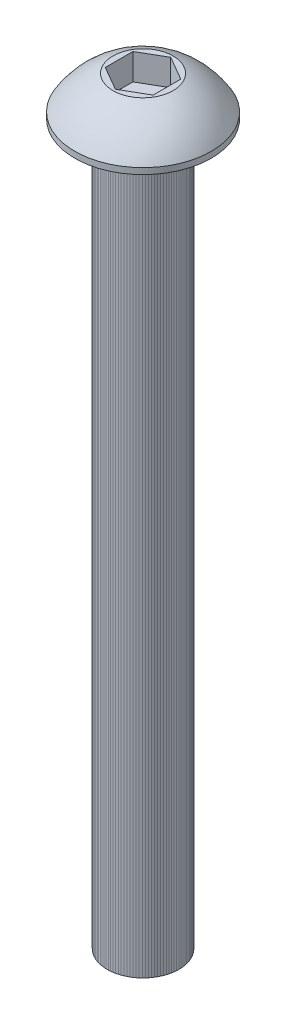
ISO-10303-21;
HEADER;
FILE_DESCRIPTION(('STEP AP214'),'2;1');
FILE_NAME('part.step','',(''),(''),'','','');
FILE_SCHEMA(('AUTOMOTIVE_DESIGN { 1 0 10303 214 1 1 1 1 }'));
ENDSEC;
DATA;
#1=APPLICATION_CONTEXT('core data for automotive mechanical design processes');
#2=APPLICATION_PROTOCOL_DEFINITION('international standard','automotive_design',2000,#1);
#3=PRODUCT_CONTEXT('',#1,'mechanical');
#4=PRODUCT('Part','Part','',(#3));
#5=PRODUCT_RELATED_PRODUCT_CATEGORY('part','',(#4));
#6=PRODUCT_DEFINITION_FORMATION('','',#4);
#7=PRODUCT_DEFINITION_CONTEXT('part definition',#1,'design');
#8=PRODUCT_DEFINITION('design','',#6,#7);
#9=PRODUCT_DEFINITION_SHAPE('','',#8);
#10=(LENGTH_UNIT() NAMED_UNIT(*) SI_UNIT(.MILLI.,.METRE.));
#11=(NAMED_UNIT(*) PLANE_ANGLE_UNIT() SI_UNIT($,.RADIAN.));
#12=(NAMED_UNIT(*) SI_UNIT($,.STERADIAN.) SOLID_ANGLE_UNIT());
#13=UNCERTAINTY_MEASURE_WITH_UNIT(LENGTH_MEASURE(1.E-05),#10,'distance_accuracy_value','');
#14=(GEOMETRIC_REPRESENTATION_CONTEXT(3) GLOBAL_UNCERTAINTY_ASSIGNED_CONTEXT((#13)) GLOBAL_UNIT_ASSIGNED_CONTEXT((#10,
#11,#12)) REPRESENTATION_CONTEXT('',''));
#15=CARTESIAN_POINT('',(0.,0.,0.));
#16=DIRECTION('',(0.,0.,1.));
#17=DIRECTION('',(1.,0.,0.));
#18=AXIS2_PLACEMENT_3D('',#15,#16,#17);
#19=CARTESIAN_POINT('',(0.,0.55,0.));
#20=DIRECTION('',(0.,1.,0.));
#21=DIRECTION('',(0.,0.,1.));
#22=AXIS2_PLACEMENT_3D('',#19,#20,#21);
#23=PLANE('',#22);
#24=DIRECTION('',(0.866025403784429,0.,0.500000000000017));
#25=VECTOR('',#24,1.);
#26=CARTESIAN_POINT('',(-1.,0.55,0.5773502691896));
#27=LINE('',#26,#25);
#28=CARTESIAN_POINT('',(-1.,0.55,0.5773502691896));
#29=VERTEX_POINT('',#28);
#30=CARTESIAN_POINT('',(0.,0.55,1.15470053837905));
#31=VERTEX_POINT('',#30);
#32=EDGE_CURVE('P0_E92',#29,#31,#27,.T.);
#33=ORIENTED_EDGE('',*,*,#32,.T.);
#34=DIRECTION('',(0.866025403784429,0.,-0.500000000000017));
#35=VECTOR('',#34,1.);
#36=CARTESIAN_POINT('',(0.,0.55,1.154700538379));
#37=LINE('',#36,#35);
#38=CARTESIAN_POINT('',(0.999999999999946,0.55,0.577350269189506));
#39=VERTEX_POINT('',#38);
#40=EDGE_CURVE('P0_E89',#31,#39,#37,.T.);
#41=ORIENTED_EDGE('',*,*,#40,.T.);
#42=DIRECTION('',(0.,0.,-1.));
#43=VECTOR('',#42,1.);
#44=CARTESIAN_POINT('',(1.,0.55,0.5773502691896));
#45=LINE('',#44,#43);
#46=CARTESIAN_POINT('',(1.,0.55,-0.5773502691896));
#47=VERTEX_POINT('',#46);
#48=EDGE_CURVE('P0_E85',#39,#47,#45,.T.);
#49=ORIENTED_EDGE('',*,*,#48,.T.);
#50=DIRECTION('',(-0.866025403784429,0.,-0.500000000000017));
#51=VECTOR('',#50,1.);
#52=CARTESIAN_POINT('',(1.,0.55,-0.5773502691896));
#53=LINE('',#52,#51);
#54=CARTESIAN_POINT('',(0.,0.55,-1.15470053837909));
#55=VERTEX_POINT('',#54);
#56=EDGE_CURVE('P0_E115',#47,#55,#53,.T.);
#57=ORIENTED_EDGE('',*,*,#56,.T.);
#58=DIRECTION('',(-0.866025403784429,0.,0.500000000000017));
#59=VECTOR('',#58,1.);
#60=CARTESIAN_POINT('',(0.,0.55,-1.154700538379));
#61=LINE('',#60,#59);
#62=CARTESIAN_POINT('',(-0.999999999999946,0.55,-0.577350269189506));
#63=VERTEX_POINT('',#62);
#64=EDGE_CURVE('P0_E171',#55,#63,#61,.T.);
#65=ORIENTED_EDGE('',*,*,#64,.T.);
#66=DIRECTION('',(0.,0.,1.));
#67=VECTOR('',#66,1.);
#68=CARTESIAN_POINT('',(-1.,0.55,-0.5773502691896));
#69=LINE('',#68,#67);
#70=EDGE_CURVE('P0_E165',#63,#29,#69,.T.);
#71=ORIENTED_EDGE('',*,*,#70,.T.);
#72=EDGE_LOOP('',(#33,#41,#49,#57,#65,#71));
#73=FACE_BOUND('',#72,.T.);
#74=ADVANCED_FACE('P0_F17',(#73),#23,.T.);
#75=CARTESIAN_POINT('',(0.,1.65,1.154700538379));
#76=DIRECTION('',(0.500000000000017,0.,0.866025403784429));
#77=DIRECTION('',(0.866025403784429,0.,-0.500000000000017));
#78=AXIS2_PLACEMENT_3D('',#75,#76,#77);
#79=PLANE('',#78);
#80=ORIENTED_EDGE('',*,*,#40,.F.);
#81=DIRECTION('',(0.,1.,0.));
#82=VECTOR('',#81,1.);
#83=CARTESIAN_POINT('',(-1.08637057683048E-13,1.65,1.15470053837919));
#84=LINE('',#83,#82);
#85=CARTESIAN_POINT('',(0.,1.65,1.15470053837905));
#86=VERTEX_POINT('',#85);
#87=EDGE_CURVE('P0_E158',#31,#86,#84,.T.);
#88=ORIENTED_EDGE('',*,*,#87,.T.);
#89=DIRECTION('',(0.866025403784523,0.,-0.499999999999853));
#90=VECTOR('',#89,1.);
#91=CARTESIAN_POINT('',(0.,1.65,1.154700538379));
#92=LINE('',#91,#90);
#93=CARTESIAN_POINT('',(0.999999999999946,1.65,0.577350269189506));
#94=VERTEX_POINT('',#93);
#95=EDGE_CURVE('P0_E101',#86,#94,#92,.T.);
#96=ORIENTED_EDGE('',*,*,#95,.T.);
#97=DIRECTION('',(0.,1.,0.));
#98=VECTOR('',#97,1.);
#99=CARTESIAN_POINT('',(1.,1.65,0.5773502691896));
#100=LINE('',#99,#98);
#101=EDGE_CURVE('P0_E96',#94,#39,#100,.F.);
#102=ORIENTED_EDGE('',*,*,#101,.T.);
#103=EDGE_LOOP('',(#80,#88,#96,#102));
#104=FACE_BOUND('',#103,.T.);
#105=ADVANCED_FACE('P0_F99',(#104),#79,.F.);
#106=CARTESIAN_POINT('',(1.,1.65,0.5773502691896));
#107=DIRECTION('',(1.,0.,0.));
#108=DIRECTION('',(0.,0.,-1.));
#109=AXIS2_PLACEMENT_3D('',#106,#107,#108);
#110=PLANE('',#109);
#111=ORIENTED_EDGE('',*,*,#48,.F.);
#112=ORIENTED_EDGE('',*,*,#101,.F.);
#113=DIRECTION('',(0.,0.,-1.));
#114=VECTOR('',#113,1.);
#115=CARTESIAN_POINT('',(1.,1.65,0.));
#116=LINE('',#115,#114);
#117=CARTESIAN_POINT('',(1.,1.65,-0.5773502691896));
#118=VERTEX_POINT('',#117);
#119=EDGE_CURVE('P0_E154',#94,#118,#116,.T.);
#120=ORIENTED_EDGE('',*,*,#119,.T.);
#121=DIRECTION('',(0.,1.,0.));
#122=VECTOR('',#121,1.);
#123=CARTESIAN_POINT('',(1.,1.65,-0.5773502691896));
#124=LINE('',#123,#122);
#125=EDGE_CURVE('P0_E108',#118,#47,#124,.F.);
#126=ORIENTED_EDGE('',*,*,#125,.T.);
#127=EDGE_LOOP('',(#111,#112,#120,#126));
#128=FACE_BOUND('',#127,.T.);
#129=ADVANCED_FACE('P0_F106',(#128),#110,.F.);
#130=CARTESIAN_POINT('',(1.,1.65,-0.5773502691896));
#131=DIRECTION('',(0.500000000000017,0.,-0.866025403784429));
#132=DIRECTION('',(-0.866025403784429,0.,-0.500000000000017));
#133=AXIS2_PLACEMENT_3D('',#130,#131,#132);
#134=PLANE('',#133);
#135=ORIENTED_EDGE('',*,*,#56,.F.);
#136=ORIENTED_EDGE('',*,*,#125,.F.);
#137=DIRECTION('',(-0.866025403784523,0.,-0.499999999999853));
#138=VECTOR('',#137,1.);
#139=CARTESIAN_POINT('',(1.,1.65,-0.5773502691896));
#140=LINE('',#139,#138);
#141=CARTESIAN_POINT('',(0.,1.65,-1.15470053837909));
#142=VERTEX_POINT('',#141);
#143=EDGE_CURVE('P0_E152',#118,#142,#140,.T.);
#144=ORIENTED_EDGE('',*,*,#143,.T.);
#145=DIRECTION('',(0.,1.,0.));
#146=VECTOR('',#145,1.);
#147=CARTESIAN_POINT('',(0.,1.65,-1.154700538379));
#148=LINE('',#147,#146);
#149=EDGE_CURVE('P0_E174',#142,#55,#148,.F.);
#150=ORIENTED_EDGE('',*,*,#149,.T.);
#151=EDGE_LOOP('',(#135,#136,#144,#150));
#152=FACE_BOUND('',#151,.T.);
#153=ADVANCED_FACE('P0_F180',(#152),#134,.F.);
#154=CARTESIAN_POINT('',(0.,1.65,-1.154700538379));
#155=DIRECTION('',(-0.500000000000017,0.,-0.866025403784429));
#156=DIRECTION('',(-0.866025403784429,0.,0.500000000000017));
#157=AXIS2_PLACEMENT_3D('',#154,#155,#156);
#158=PLANE('',#157);
#159=ORIENTED_EDGE('',*,*,#64,.F.);
#160=ORIENTED_EDGE('',*,*,#149,.F.);
#161=DIRECTION('',(-0.866025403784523,0.,0.499999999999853));
#162=VECTOR('',#161,1.);
#163=CARTESIAN_POINT('',(0.,1.65,-1.154700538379));
#164=LINE('',#163,#162);
#165=CARTESIAN_POINT('',(-0.999999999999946,1.65,-0.577350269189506));
#166=VERTEX_POINT('',#165);
#167=EDGE_CURVE('P0_E145',#142,#166,#164,.T.);
#168=ORIENTED_EDGE('',*,*,#167,.T.);
#169=DIRECTION('',(0.,1.,0.));
#170=VECTOR('',#169,1.);
#171=CARTESIAN_POINT('',(-1.,1.65,-0.5773502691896));
#172=LINE('',#171,#170);
#173=EDGE_CURVE('P0_E168',#166,#63,#172,.F.);
#174=ORIENTED_EDGE('',*,*,#173,.T.);
#175=EDGE_LOOP('',(#159,#160,#168,#174));
#176=FACE_BOUND('',#175,.T.);
#177=ADVANCED_FACE('P0_F184',(#176),#158,.F.);
#178=CARTESIAN_POINT('',(-1.,1.65,-0.5773502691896));
#179=DIRECTION('',(-1.,0.,0.));
#180=DIRECTION('',(0.,0.,1.));
#181=AXIS2_PLACEMENT_3D('',#178,#179,#180);
#182=PLANE('',#181);
#183=ORIENTED_EDGE('',*,*,#70,.F.);
#184=ORIENTED_EDGE('',*,*,#173,.F.);
#185=DIRECTION('',(0.,0.,-1.));
#186=VECTOR('',#185,1.);
#187=CARTESIAN_POINT('',(-1.,1.65,0.));
#188=LINE('',#187,#186);
#189=CARTESIAN_POINT('',(-1.,1.65,0.5773502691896));
#190=VERTEX_POINT('',#189);
#191=EDGE_CURVE('P0_E44',#166,#190,#188,.F.);
#192=ORIENTED_EDGE('',*,*,#191,.T.);
#193=DIRECTION('',(0.,1.,0.));
#194=VECTOR('',#193,1.);
#195=CARTESIAN_POINT('',(-1.,1.65,0.5773502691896));
#196=LINE('',#195,#194);
#197=EDGE_CURVE('P0_E163',#190,#29,#196,.F.);
#198=ORIENTED_EDGE('',*,*,#197,.T.);
#199=EDGE_LOOP('',(#183,#184,#192,#198));
#200=FACE_BOUND('',#199,.T.);
#201=ADVANCED_FACE('P0_F186',(#200),#182,.F.);
#202=CARTESIAN_POINT('',(-1.,1.65,0.5773502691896));
#203=DIRECTION('',(-0.500000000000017,0.,0.866025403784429));
#204=DIRECTION('',(0.866025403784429,0.,0.500000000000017));
#205=AXIS2_PLACEMENT_3D('',#202,#203,#204);
#206=PLANE('',#205);
#207=ORIENTED_EDGE('',*,*,#32,.F.);
#208=ORIENTED_EDGE('',*,*,#197,.F.);
#209=DIRECTION('',(0.866025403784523,0.,0.499999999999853));
#210=VECTOR('',#209,1.);
#211=CARTESIAN_POINT('',(-1.,1.65,0.5773502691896));
#212=LINE('',#211,#210);
#213=EDGE_CURVE('P0_E133',#190,#86,#212,.T.);
#214=ORIENTED_EDGE('',*,*,#213,.T.);
#215=ORIENTED_EDGE('',*,*,#87,.F.);
#216=EDGE_LOOP('',(#207,#208,#214,#215));
#217=FACE_BOUND('',#216,.T.);
#218=ADVANCED_FACE('P0_F187',(#217),#206,.F.);
#219=CARTESIAN_POINT('',(0.,1.65,0.));
#220=DIRECTION('',(0.,-1.,0.));
#221=DIRECTION('',(0.,0.,-1.));
#222=AXIS2_PLACEMENT_3D('',#219,#220,#221);
#223=PLANE('',#222);
#224=ORIENTED_EDGE('',*,*,#191,.F.);
#225=ORIENTED_EDGE('',*,*,#167,.F.);
#226=ORIENTED_EDGE('',*,*,#143,.F.);
#227=ORIENTED_EDGE('',*,*,#119,.F.);
#228=ORIENTED_EDGE('',*,*,#95,.F.);
#229=ORIENTED_EDGE('',*,*,#213,.F.);
#230=EDGE_LOOP('',(#224,#225,#226,#227,#228,#229));
#231=FACE_BOUND('',#230,.T.);
#232=CARTESIAN_POINT('',(-1.25470053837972,1.65,0.));
#233=CARTESIAN_POINT('',(-1.2546965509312,1.64999999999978,-0.070424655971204));
#234=CARTESIAN_POINT('',(-1.24873864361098,1.64999999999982,-0.140974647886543));
#235=CARTESIAN_POINT('',(-1.23101016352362,1.65000000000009,-0.245237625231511));
#236=CARTESIAN_POINT('',(-1.22361994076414,1.65000000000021,-0.279775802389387));
#237=CARTESIAN_POINT('',(-1.20595086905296,1.64999999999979,-0.348140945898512));
#238=CARTESIAN_POINT('',(-1.19566967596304,1.64999999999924,-0.381967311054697));
#239=CARTESIAN_POINT('',(-1.16063107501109,1.64999999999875,-0.481845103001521));
#240=CARTESIAN_POINT('',(-1.13164986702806,1.64999999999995,-0.546463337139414));
#241=CARTESIAN_POINT('',(-1.0632361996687,1.65000000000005,-0.669911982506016));
#242=CARTESIAN_POINT('',(-1.02380334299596,1.64999999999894,-0.728742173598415));
#243=CARTESIAN_POINT('',(-0.957707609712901,1.64999999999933,-0.811368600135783));
#244=CARTESIAN_POINT('',(-0.934500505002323,1.6499999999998,-0.837989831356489));
#245=CARTESIAN_POINT('',(-0.885952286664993,1.6500000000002,-0.889159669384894));
#246=CARTESIAN_POINT('',(-0.86061325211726,1.65000000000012,-0.913710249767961));
#247=CARTESIAN_POINT('',(-0.78160082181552,1.64999999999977,-0.984041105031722));
#248=CARTESIAN_POINT('',(-0.724917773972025,1.6499999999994,-1.02651836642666));
#249=CARTESIAN_POINT('',(-0.605255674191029,1.64999999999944,-1.10132851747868));
#250=CARTESIAN_POINT('',(-0.542276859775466,1.64999999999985,-1.13366178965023));
#251=CARTESIAN_POINT('',(-0.411777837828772,1.65000000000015,-1.18730210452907));
#252=CARTESIAN_POINT('',(-0.344257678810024,1.65000000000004,-1.20860926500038));
#253=CARTESIAN_POINT('',(-0.206600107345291,1.64999999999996,-1.23958383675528));
#254=CARTESIAN_POINT('',(-0.136462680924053,1.64999999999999,-1.24925118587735));
#255=CARTESIAN_POINT('',(0.00443971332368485,1.65000000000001,-1.2566745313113));
#256=CARTESIAN_POINT('',(0.075204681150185,1.65,-1.25443052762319));
#257=CARTESIAN_POINT('',(0.21535490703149,1.65,-1.23809206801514));
#258=CARTESIAN_POINT('',(0.284740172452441,1.65,-1.22399767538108));
#259=CARTESIAN_POINT('',(0.42015312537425,1.65,-1.18436674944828));
#260=CARTESIAN_POINT('',(0.486180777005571,1.65,-1.1588300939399));
#261=CARTESIAN_POINT('',(0.613041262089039,1.65,-1.09700781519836));
#262=CARTESIAN_POINT('',(0.673873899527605,1.65,-1.06072178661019));
#263=CARTESIAN_POINT('',(0.759839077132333,1.65,-0.999082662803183));
#264=CARTESIAN_POINT('',(0.787617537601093,1.65,-0.977330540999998));
#265=CARTESIAN_POINT('',(0.8412737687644,1.65,-0.931545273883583));
#266=CARTESIAN_POINT('',(0.867149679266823,1.64999999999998,-0.907509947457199));
#267=CARTESIAN_POINT('',(0.941561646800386,1.65000000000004,-0.832286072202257));
#268=CARTESIAN_POINT('',(0.986957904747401,1.6500000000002,-0.7779250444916));
#269=CARTESIAN_POINT('',(1.06796444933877,1.6499999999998,-0.662348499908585));
#270=CARTESIAN_POINT('',(1.1035751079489,1.64999999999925,-0.601133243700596));
#271=CARTESIAN_POINT('',(1.1489145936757,1.64999999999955,-0.505490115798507));
#272=CARTESIAN_POINT('',(1.16269324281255,1.64999999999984,-0.472931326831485));
#273=CARTESIAN_POINT('',(1.18744810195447,1.65000000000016,-0.406801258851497));
#274=CARTESIAN_POINT('',(1.19842657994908,1.65000000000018,-0.373230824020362));
#275=CARTESIAN_POINT('',(1.22701255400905,1.64999999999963,-0.271407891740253));
#276=CARTESIAN_POINT('',(1.24035065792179,1.64999999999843,-0.201874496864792));
#277=CARTESIAN_POINT('',(1.25006989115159,1.64999999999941,-0.109940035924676));
#278=CARTESIAN_POINT('',(1.25180488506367,1.64999999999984,-0.0879909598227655));
#279=CARTESIAN_POINT('',(1.25412083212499,1.65000000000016,-0.0440320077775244));
#280=CARTESIAN_POINT('',(1.25470178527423,1.65000000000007,-0.0220221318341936));
#281=CARTESIAN_POINT('',(1.2546965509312,1.64999999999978,0.0704246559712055));
#282=CARTESIAN_POINT('',(1.24873864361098,1.64999999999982,0.140974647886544));
#283=CARTESIAN_POINT('',(1.23101016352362,1.65000000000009,0.245237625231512));
#284=CARTESIAN_POINT('',(1.22361994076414,1.65000000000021,0.279775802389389));
#285=CARTESIAN_POINT('',(1.20595086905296,1.64999999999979,0.348140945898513));
#286=CARTESIAN_POINT('',(1.19566967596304,1.64999999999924,0.381967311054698));
#287=CARTESIAN_POINT('',(1.16063107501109,1.64999999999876,0.481845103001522));
#288=CARTESIAN_POINT('',(1.13164986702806,1.64999999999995,0.546463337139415));
#289=CARTESIAN_POINT('',(1.0632361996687,1.65000000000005,0.669911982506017));
#290=CARTESIAN_POINT('',(1.02380334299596,1.64999999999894,0.728742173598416));
#291=CARTESIAN_POINT('',(0.9577076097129,1.64999999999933,0.811368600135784));
#292=CARTESIAN_POINT('',(0.934500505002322,1.6499999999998,0.83798983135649));
#293=CARTESIAN_POINT('',(0.885952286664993,1.6500000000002,0.889159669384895));
#294=CARTESIAN_POINT('',(0.860613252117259,1.65000000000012,0.913710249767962));
#295=CARTESIAN_POINT('',(0.781600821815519,1.64999999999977,0.984041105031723));
#296=CARTESIAN_POINT('',(0.724917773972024,1.6499999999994,1.02651836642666));
#297=CARTESIAN_POINT('',(0.605255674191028,1.64999999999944,1.10132851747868));
#298=CARTESIAN_POINT('',(0.542276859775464,1.64999999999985,1.13366178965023));
#299=CARTESIAN_POINT('',(0.411777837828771,1.65000000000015,1.18730210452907));
#300=CARTESIAN_POINT('',(0.344257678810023,1.65000000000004,1.20860926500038));
#301=CARTESIAN_POINT('',(0.20660010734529,1.64999999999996,1.23958383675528));
#302=CARTESIAN_POINT('',(0.136462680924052,1.64999999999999,1.24925118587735));
#303=CARTESIAN_POINT('',(-0.00443971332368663,1.65000000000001,1.2566745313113));
#304=CARTESIAN_POINT('',(-0.0752046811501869,1.65,1.25443052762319));
#305=CARTESIAN_POINT('',(-0.215354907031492,1.65,1.23809206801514));
#306=CARTESIAN_POINT('',(-0.284740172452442,1.65,1.22399767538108));
#307=CARTESIAN_POINT('',(-0.420153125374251,1.65,1.18436674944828));
#308=CARTESIAN_POINT('',(-0.486180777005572,1.65,1.1588300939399));
#309=CARTESIAN_POINT('',(-0.61304126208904,1.65,1.09700781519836));
#310=CARTESIAN_POINT('',(-0.673873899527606,1.65,1.06072178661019));
#311=CARTESIAN_POINT('',(-0.759839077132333,1.65,0.999082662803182));
#312=CARTESIAN_POINT('',(-0.787617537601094,1.65000000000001,0.977330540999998));
#313=CARTESIAN_POINT('',(-0.8412737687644,1.64999999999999,0.931545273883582));
#314=CARTESIAN_POINT('',(-0.867149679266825,1.64999999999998,0.907509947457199));
#315=CARTESIAN_POINT('',(-0.941561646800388,1.65000000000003,0.832286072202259));
#316=CARTESIAN_POINT('',(-0.986957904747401,1.6500000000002,0.7779250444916));
#317=CARTESIAN_POINT('',(-1.06796444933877,1.6499999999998,0.662348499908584));
#318=CARTESIAN_POINT('',(-1.10357510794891,1.64999999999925,0.601133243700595));
#319=CARTESIAN_POINT('',(-1.1489145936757,1.64999999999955,0.505490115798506));
#320=CARTESIAN_POINT('',(-1.16269324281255,1.64999999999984,0.472931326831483));
#321=CARTESIAN_POINT('',(-1.18744810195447,1.65000000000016,0.406801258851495));
#322=CARTESIAN_POINT('',(-1.19842657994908,1.65000000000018,0.373230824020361));
#323=CARTESIAN_POINT('',(-1.22701255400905,1.64999999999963,0.271407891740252));
#324=CARTESIAN_POINT('',(-1.24035065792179,1.64999999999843,0.20187449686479));
#325=CARTESIAN_POINT('',(-1.25006989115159,1.64999999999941,0.109940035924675));
#326=CARTESIAN_POINT('',(-1.25180488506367,1.64999999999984,0.0879909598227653));
#327=CARTESIAN_POINT('',(-1.25412083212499,1.65000000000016,0.0440320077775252));
#328=CARTESIAN_POINT('',(-1.25470178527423,1.65000000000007,0.0220221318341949));
#329=CARTESIAN_POINT('',(-1.25470053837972,1.65,0.));
#330=B_SPLINE_CURVE_WITH_KNOTS('',3,(#232,#233,#234,#235,#236,#237,#238,#239,#240,#241,#242,
#243,#244,#245,#246,#247,#248,#249,#250,#251,#252,#253,#254,#255,#256,#257,#258,#259,#260,#261,
#262,#263,#264,#265,#266,#267,#268,#269,#270,#271,#272,#273,#274,#275,#276,#277,#278,#279,#280,
#281,#282,#283,#284,#285,#286,#287,#288,#289,#290,#291,#292,#293,#294,#295,#296,#297,#298,#299,
#300,#301,#302,#303,#304,#305,#306,#307,#308,#309,#310,#311,#312,#313,#314,#315,#316,#317,#318,
#319,#320,#321,#322,#323,#324,#325,#326,#327,#328,#329),.UNSPECIFIED.,.T.,.F.,(4,2,2,2,2,2,2,2,
2,2,2,2,2,2,2,2,2,2,2,2,2,2,2,2,2,2,2,2,2,2,2,2,2,2,2,2,2,2,2,2,2,2,2,2,2,2,2,2,4),(0.,
0.211171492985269,0.317034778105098,0.422984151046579,0.634377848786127,0.84577958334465,
0.951618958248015,1.05735628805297,1.26876310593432,1.48016195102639,1.6915585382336,
1.90295625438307,2.1143539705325,2.32575055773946,2.53714940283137,2.74855622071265,
2.85429355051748,2.96013292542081,3.17153465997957,3.38292835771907,3.48887773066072,
3.59474101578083,3.80591250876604,3.87194685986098,3.93798121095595,4.14915270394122,
4.25501598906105,4.36096536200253,4.57235905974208,4.7837607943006,4.88960016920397,
4.99533749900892,5.20674431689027,5.41814316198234,5.62953974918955,5.84093746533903,
6.05233518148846,6.26373176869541,6.47513061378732,6.68653743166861,6.79227476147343,
6.89811413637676,7.10951587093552,7.32090956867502,7.42685894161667,7.53272222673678,
7.74389371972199,7.80992807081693,7.8759624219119),.UNSPECIFIED.);
#331=CARTESIAN_POINT('',(-1.25470053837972,1.65,0.));
#332=VERTEX_POINT('',#331);
#333=EDGE_CURVE('P0_E20',#332,#332,#330,.T.);
#334=ORIENTED_EDGE('',*,*,#333,.F.);
#335=EDGE_LOOP('',(#334));
#336=FACE_BOUND('',#335,.T.);
#337=ADVANCED_FACE('P0_F189',(#231,#336),#223,.F.);
#338=CARTESIAN_POINT('',(0.,-1.39317183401,0.));
#339=DIRECTION('',(-1.,0.,0.));
#340=DIRECTION('',(0.,0.,-1.));
#341=AXIS2_PLACEMENT_3D('',#338,#339,#340);
#342=SPHERICAL_SURFACE('',#341,3.291681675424);
#343=ORIENTED_EDGE('',*,*,#333,.T.);
#344=EDGE_LOOP('',(#343));
#345=FACE_BOUND('',#344,.T.);
#346=CARTESIAN_POINT('',(0.,0.2538461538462,0.));
#347=DIRECTION('',(0.,-1.,0.));
#348=DIRECTION('',(0.,0.,-1.));
#349=AXIS2_PLACEMENT_3D('',#346,#347,#348);
#350=CIRCLE('',#349,2.85);
#351=CARTESIAN_POINT('',(0.,0.2538461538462,-2.85));
#352=VERTEX_POINT('',#351);
#353=EDGE_CURVE('P0_E125',#352,#352,#350,.T.);
#354=ORIENTED_EDGE('',*,*,#353,.F.);
#355=EDGE_LOOP('',(#354));
#356=FACE_BOUND('',#355,.T.);
#357=ADVANCED_FACE('P0_F196',(#345,#356),#342,.T.);
#358=CARTESIAN_POINT('',(0.,1.993435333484,0.));
#359=DIRECTION('',(0.,-1.,0.));
#360=DIRECTION('',(0.,0.,-1.));
#361=AXIS2_PLACEMENT_3D('',#358,#359,#360);
#362=CYLINDRICAL_SURFACE('',#361,2.85);
#363=ORIENTED_EDGE('',*,*,#353,.T.);
#364=EDGE_LOOP('',(#363));
#365=FACE_BOUND('',#364,.T.);
#366=CARTESIAN_POINT('',(0.,0.,0.));
#367=DIRECTION('',(0.,-1.,0.));
#368=DIRECTION('',(0.,0.,-1.));
#369=AXIS2_PLACEMENT_3D('',#366,#367,#368);
#370=CIRCLE('',#369,2.85);
#371=CARTESIAN_POINT('',(0.,0.,-2.85));
#372=VERTEX_POINT('',#371);
#373=EDGE_CURVE('P0_E122',#372,#372,#370,.T.);
#374=ORIENTED_EDGE('',*,*,#373,.F.);
#375=EDGE_LOOP('',(#374));
#376=FACE_BOUND('',#375,.T.);
#377=ADVANCED_FACE('P0_F215',(#365,#376),#362,.T.);
#378=CARTESIAN_POINT('',(0.,-30.,0.));
#379=DIRECTION('',(0.,-1.,0.));
#380=DIRECTION('',(0.,0.,-1.));
#381=AXIS2_PLACEMENT_3D('',#378,#379,#380);
#382=PLANE('',#381);
#383=CARTESIAN_POINT('',(0.,-30.,0.));
#384=DIRECTION('',(0.,-1.,0.));
#385=DIRECTION('',(0.,0.,-1.));
#386=AXIS2_PLACEMENT_3D('',#383,#384,#385);
#387=CIRCLE('',#386,1.5);
#388=CARTESIAN_POINT('',(0.,-30.,-1.5));
#389=VERTEX_POINT('',#388);
#390=EDGE_CURVE('P0_E31',#389,#389,#387,.F.);
#391=ORIENTED_EDGE('',*,*,#390,.F.);
#392=EDGE_LOOP('',(#391));
#393=FACE_BOUND('',#392,.T.);
#394=ADVANCED_FACE('P0_F208',(#393),#382,.T.);
#395=CARTESIAN_POINT('',(0.,0.,0.));
#396=DIRECTION('',(0.,-1.,0.));
#397=DIRECTION('',(0.,0.,-1.));
#398=AXIS2_PLACEMENT_3D('',#395,#396,#397);
#399=PLANE('',#398);
#400=CARTESIAN_POINT('',(0.,0.,0.));
#401=DIRECTION('',(0.,-1.,0.));
#402=DIRECTION('',(0.,0.,-1.));
#403=AXIS2_PLACEMENT_3D('',#400,#401,#402);
#404=CIRCLE('',#403,1.5);
#405=CARTESIAN_POINT('',(0.,0.,-1.5));
#406=VERTEX_POINT('',#405);
#407=EDGE_CURVE('P0_E11',#406,#406,#404,.T.);
#408=ORIENTED_EDGE('',*,*,#407,.F.);
#409=EDGE_LOOP('',(#408));
#410=FACE_BOUND('',#409,.T.);
#411=ORIENTED_EDGE('',*,*,#373,.T.);
#412=EDGE_LOOP('',(#411));
#413=FACE_BOUND('',#412,.T.);
#414=ADVANCED_FACE('P0_F201',(#410,#413),#399,.T.);
#415=CARTESIAN_POINT('',(0.,0.,0.));
#416=DIRECTION('',(0.,-1.,0.));
#417=DIRECTION('',(0.,0.,-1.));
#418=AXIS2_PLACEMENT_3D('',#415,#416,#417);
#419=CYLINDRICAL_SURFACE('',#418,1.5);
#420=ORIENTED_EDGE('',*,*,#390,.T.);
#421=EDGE_LOOP('',(#420));
#422=FACE_BOUND('',#421,.T.);
#423=ORIENTED_EDGE('',*,*,#407,.T.);
#424=EDGE_LOOP('',(#423));
#425=FACE_BOUND('',#424,.T.);
#426=ADVANCED_FACE('P0_F199',(#422,#425),#419,.T.);
#427=CLOSED_SHELL('',(#74,#105,#129,#153,#177,#201,#218,#337,#357,#377,#394,#414,#426));
#428=MANIFOLD_SOLID_BREP('P0_B1',#427);
#429=CARTESIAN_POINT('',(0.,-30.,0.));
#430=DIRECTION('',(0.,1.,0.));
#431=DIRECTION('',(0.,0.,1.));
#432=AXIS2_PLACEMENT_3D('',#429,#430,#431);
#433=CYLINDRICAL_SURFACE('',#432,1.5);
#434=CARTESIAN_POINT('',(0.,0.,0.));
#435=DIRECTION('',(0.,1.,0.));
#436=DIRECTION('',(0.,0.,1.));
#437=AXIS2_PLACEMENT_3D('',#434,#435,#436);
#438=CIRCLE('',#437,1.5);
#439=CARTESIAN_POINT('',(0.,0.,1.5));
#440=VERTEX_POINT('',#439);
#441=EDGE_CURVE('P1_E16',#440,#440,#438,.F.);
#442=ORIENTED_EDGE('',*,*,#441,.T.);
#443=EDGE_LOOP('',(#442));
#444=FACE_BOUND('',#443,.T.);
#445=CARTESIAN_POINT('',(0.,-30.,0.));
#446=DIRECTION('',(0.,1.,0.));
#447=DIRECTION('',(0.,0.,1.));
#448=AXIS2_PLACEMENT_3D('',#445,#446,#447);
#449=CIRCLE('',#448,1.5);
#450=CARTESIAN_POINT('',(0.,-30.,1.5));
#451=VERTEX_POINT('',#450);
#452=EDGE_CURVE('P1_E10',#451,#451,#449,.T.);
#453=ORIENTED_EDGE('',*,*,#452,.T.);
#454=EDGE_LOOP('',(#453));
#455=FACE_BOUND('',#454,.T.);
#456=ADVANCED_FACE('P1_F15',(#444,#455),#433,.T.);
#457=OPEN_SHELL('',(#456));
#458=SHELL_BASED_SURFACE_MODEL('P1_B1',(#457));
#459=ADVANCED_BREP_SHAPE_REPRESENTATION('',(#18,#428),#14);
#460=MANIFOLD_SURFACE_SHAPE_REPRESENTATION('',(#18,#458),#14);
#461=SHAPE_REPRESENTATION('',(#18),#14);
#462=SHAPE_DEFINITION_REPRESENTATION(#9,#461);
#463=SHAPE_REPRESENTATION_RELATIONSHIP('','',#461,#459);
#464=SHAPE_REPRESENTATION_RELATIONSHIP('','',#461,#460);
ENDSEC;
END-ISO-10303-21;
